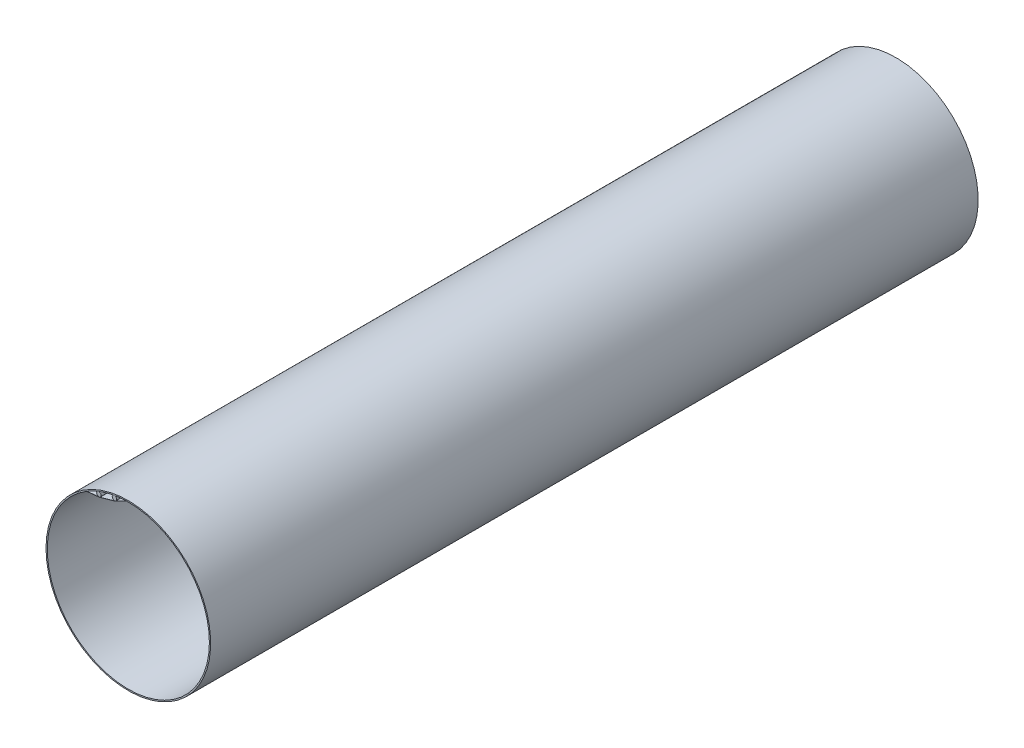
from build123d import *

# Parameters (mm, degrees)
SKETCH3_R        = 468.1982
SKETCH3_R_2      = 461.01
EXTRUDE3_DEPTH   = 4365.10176
SKETCH2_R        = 12.7
EXTRUDE2_DEPTH   = 4365.0916
EXTRUDE2_2_DEPTH = 4365.0916
EXTRUDE4_DEPTH   = 4365.10176


with BuildPart() as part:
    # Sketch3 → Extrude3 (new body)
    with BuildSketch(Plane(origin=(0, 0, -4365.0916), x_dir=(-1, 0, 0), z_dir=(0, 0, -1))):
        Circle(SKETCH3_R)
        Circle(SKETCH3_R_2, mode=Mode.SUBTRACT)
    extrude(amount=-EXTRUDE3_DEPTH)

    # Sketch4 → Extrude4 (add)
    with BuildSketch(Plane(origin=(0, 0, -4365.0916), x_dir=(-1, 0, 0), z_dir=(0, 0, -1))):
        with BuildLine():
            Line((10.591007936, 460.888327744), (75.178666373, 428.64825773))
            Line((75.178666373, 428.64825773), (163.393844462, 403.35296246))
            Line((163.393844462, 403.35296246), (235.251919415, 396.467848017))
            ThreePointArc((235.251919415, 396.467848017), (236.017590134, 396.012521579), (236.782379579, 395.555716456))
            Line((236.782379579, 395.555716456), (163.2512877, 402.601131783))
            Line((163.2512877, 402.601131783), (74.901151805, 427.935125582))
            Line((74.901151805, 427.935125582), (8.809748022, 460.925816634))
            ThreePointArc((8.809748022, 460.925816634), (9.70039609, 460.907932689), (10.591007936, 460.888327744))
        make_face()
    extrude(amount=-EXTRUDE4_DEPTH)


with BuildPart() as body_2:
    # Sketch2 → Extrude2 (new body)
    with BuildSketch(Plane(origin=(0, 0, -4365.0916), x_dir=(-1, 0, 0), z_dir=(0, 0, -1))):
        with Locations((78.814438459, 441.327701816)):
            Circle(SKETCH2_R)
    extrude(amount=-EXTRUDE2_DEPTH)


with BuildPart() as body_3:
    # Sketch2 → Extrude2 2 (new body)
    with BuildSketch(Plane(origin=(0, 0, -4365.0916), x_dir=(-1, 0, 0), z_dir=(0, 0, -1))):
        with Locations((167.029616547, 416.032406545)):
            Circle(SKETCH2_R)
    extrude(amount=-EXTRUDE2_2_DEPTH)


solid = Compound([part.part, body_2.part, body_3.part])
